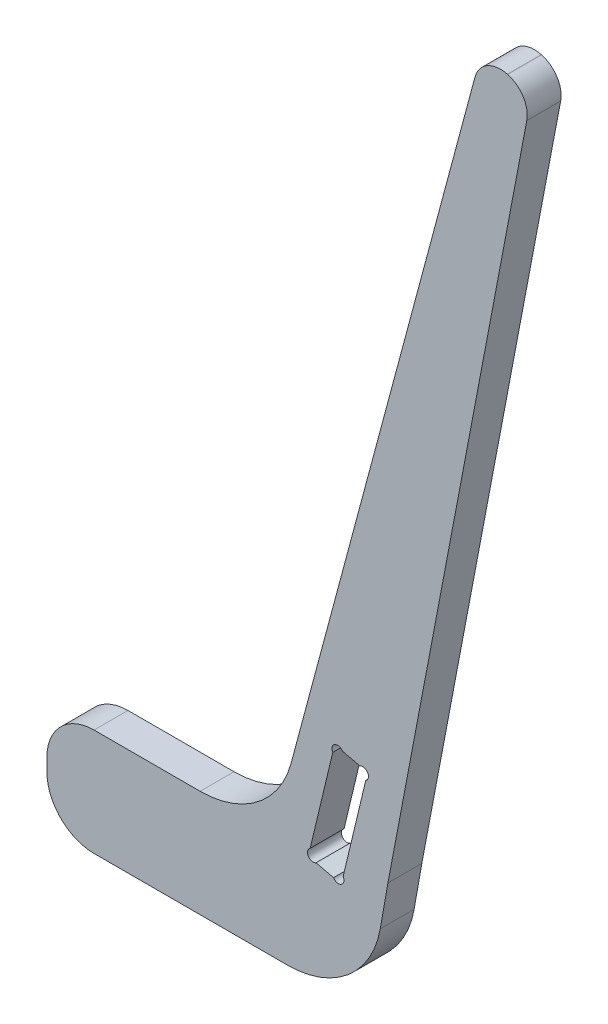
ISO-10303-21;
HEADER;
FILE_DESCRIPTION(('STEP AP214'),'2;1');
FILE_NAME('part.step','',(''),(''),'','','');
FILE_SCHEMA(('AUTOMOTIVE_DESIGN { 1 0 10303 214 1 1 1 1 }'));
ENDSEC;
DATA;
#1=APPLICATION_CONTEXT('core data for automotive mechanical design processes');
#2=APPLICATION_PROTOCOL_DEFINITION('international standard','automotive_design',2000,#1);
#3=PRODUCT_CONTEXT('',#1,'mechanical');
#4=PRODUCT('Part','Part','',(#3));
#5=PRODUCT_RELATED_PRODUCT_CATEGORY('part','',(#4));
#6=PRODUCT_DEFINITION_FORMATION('','',#4);
#7=PRODUCT_DEFINITION_CONTEXT('part definition',#1,'design');
#8=PRODUCT_DEFINITION('design','',#6,#7);
#9=PRODUCT_DEFINITION_SHAPE('','',#8);
#10=(LENGTH_UNIT() NAMED_UNIT(*) SI_UNIT(.MILLI.,.METRE.));
#11=(NAMED_UNIT(*) PLANE_ANGLE_UNIT() SI_UNIT($,.RADIAN.));
#12=(NAMED_UNIT(*) SI_UNIT($,.STERADIAN.) SOLID_ANGLE_UNIT());
#13=UNCERTAINTY_MEASURE_WITH_UNIT(LENGTH_MEASURE(1.E-05),#10,'distance_accuracy_value','');
#14=(GEOMETRIC_REPRESENTATION_CONTEXT(3) GLOBAL_UNCERTAINTY_ASSIGNED_CONTEXT((#13)) GLOBAL_UNIT_ASSIGNED_CONTEXT((#10,
#11,#12)) REPRESENTATION_CONTEXT('',''));
#15=CARTESIAN_POINT('',(0.,0.,0.));
#16=DIRECTION('',(0.,0.,1.));
#17=DIRECTION('',(1.,0.,0.));
#18=AXIS2_PLACEMENT_3D('',#15,#16,#17);
#19=CARTESIAN_POINT('',(589.307159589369,-157.904377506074,18.));
#20=DIRECTION('',(0.965925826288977,-0.258819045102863,0.));
#21=DIRECTION('',(0.258819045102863,0.965925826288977,0.));
#22=AXIS2_PLACEMENT_3D('',#19,#20,#21);
#23=PLANE('',#22);
#24=DIRECTION('',(-0.258819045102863,-0.965925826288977,0.));
#25=VECTOR('',#24,1.);
#26=CARTESIAN_POINT('',(589.307159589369,-157.904377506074,18.));
#27=LINE('',#26,#25);
#28=CARTESIAN_POINT('',(735.435185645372,387.452840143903,18.));
#29=VERTEX_POINT('',#28);
#30=CARTESIAN_POINT('',(637.838508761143,23.2170833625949,18.));
#31=VERTEX_POINT('',#30);
#32=EDGE_CURVE('E318',#29,#31,#27,.T.);
#33=ORIENTED_EDGE('',*,*,#32,.F.);
#34=DIRECTION('',(0.,0.,-1.));
#35=VECTOR('',#34,1.);
#36=CARTESIAN_POINT('',(735.435185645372,387.452840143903,0.));
#37=LINE('',#36,#35);
#38=CARTESIAN_POINT('',(735.435185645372,387.452840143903,0.));
#39=VERTEX_POINT('',#38);
#40=EDGE_CURVE('E186',#29,#39,#37,.T.);
#41=ORIENTED_EDGE('',*,*,#40,.T.);
#42=DIRECTION('',(-0.258819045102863,-0.965925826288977,0.));
#43=VECTOR('',#42,1.);
#44=CARTESIAN_POINT('',(589.307159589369,-157.904377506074,0.));
#45=LINE('',#44,#43);
#46=CARTESIAN_POINT('',(637.838508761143,23.2170833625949,0.));
#47=VERTEX_POINT('',#46);
#48=EDGE_CURVE('E217',#39,#47,#45,.T.);
#49=ORIENTED_EDGE('',*,*,#48,.T.);
#50=DIRECTION('',(0.,0.,-1.));
#51=VECTOR('',#50,1.);
#52=CARTESIAN_POINT('',(637.838508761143,23.2170833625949,18.));
#53=LINE('',#52,#51);
#54=EDGE_CURVE('E251',#31,#47,#53,.T.);
#55=ORIENTED_EDGE('',*,*,#54,.F.);
#56=EDGE_LOOP('',(#33,#41,#49,#55));
#57=FACE_BOUND('',#56,.T.);
#58=ADVANCED_FACE('F35',(#57),#23,.F.);
#59=CARTESIAN_POINT('',(589.542217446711,36.1580356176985,18.));
#60=DIRECTION('',(0.,0.,-1.));
#61=DIRECTION('',(-1.,0.,0.));
#62=AXIS2_PLACEMENT_3D('',#59,#60,#61);
#63=CYLINDRICAL_SURFACE('',#62,50.);
#64=CARTESIAN_POINT('',(589.542217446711,36.1580356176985,0.));
#65=DIRECTION('',(0.,0.,1.));
#66=DIRECTION('',(1.,0.,0.));
#67=AXIS2_PLACEMENT_3D('',#64,#65,#66);
#68=CIRCLE('',#67,50.);
#69=CARTESIAN_POINT('',(589.542217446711,-13.8419643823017,0.));
#70=VERTEX_POINT('',#69);
#71=EDGE_CURVE('E219',#47,#70,#68,.F.);
#72=ORIENTED_EDGE('',*,*,#71,.T.);
#73=DIRECTION('',(0.,0.,-1.));
#74=VECTOR('',#73,1.);
#75=CARTESIAN_POINT('',(589.542217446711,-13.8419643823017,18.));
#76=LINE('',#75,#74);
#77=CARTESIAN_POINT('',(589.542217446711,-13.8419643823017,18.));
#78=VERTEX_POINT('',#77);
#79=EDGE_CURVE('E248',#78,#70,#76,.T.);
#80=ORIENTED_EDGE('',*,*,#79,.F.);
#81=CARTESIAN_POINT('',(589.542217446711,36.1580356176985,18.));
#82=DIRECTION('',(0.,0.,1.));
#83=DIRECTION('',(1.,0.,0.));
#84=AXIS2_PLACEMENT_3D('',#81,#82,#83);
#85=CIRCLE('',#84,50.);
#86=EDGE_CURVE('E320',#31,#78,#85,.F.);
#87=ORIENTED_EDGE('',*,*,#86,.F.);
#88=ORIENTED_EDGE('',*,*,#54,.T.);
#89=EDGE_LOOP('',(#72,#80,#87,#88));
#90=FACE_BOUND('',#89,.T.);
#91=ADVANCED_FACE('F390',(#90),#63,.F.);
#92=CARTESIAN_POINT('',(0.,-13.8419643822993,18.));
#93=DIRECTION('',(0.,1.,0.));
#94=DIRECTION('',(-1.,0.,0.));
#95=AXIS2_PLACEMENT_3D('',#92,#93,#94);
#96=PLANE('',#95);
#97=DIRECTION('',(1.,0.,0.));
#98=VECTOR('',#97,1.);
#99=CARTESIAN_POINT('',(0.,-13.8419643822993,0.));
#100=LINE('',#99,#98);
#101=CARTESIAN_POINT('',(533.208645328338,-13.8419643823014,0.));
#102=VERTEX_POINT('',#101);
#103=EDGE_CURVE('E222',#102,#70,#100,.T.);
#104=ORIENTED_EDGE('',*,*,#103,.F.);
#105=DIRECTION('',(0.,0.,-1.));
#106=VECTOR('',#105,1.);
#107=CARTESIAN_POINT('',(533.208645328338,-13.8419643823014,18.));
#108=LINE('',#107,#106);
#109=CARTESIAN_POINT('',(533.208645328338,-13.8419643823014,18.));
#110=VERTEX_POINT('',#109);
#111=EDGE_CURVE('E270',#102,#110,#108,.F.);
#112=ORIENTED_EDGE('',*,*,#111,.T.);
#113=DIRECTION('',(1.,0.,0.));
#114=VECTOR('',#113,1.);
#115=CARTESIAN_POINT('',(0.,-13.8419643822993,18.));
#116=LINE('',#115,#114);
#117=EDGE_CURVE('E323',#110,#78,#116,.T.);
#118=ORIENTED_EDGE('',*,*,#117,.T.);
#119=ORIENTED_EDGE('',*,*,#79,.T.);
#120=EDGE_LOOP('',(#104,#112,#118,#119));
#121=FACE_BOUND('',#120,.T.);
#122=ADVANCED_FACE('F386',(#121),#96,.T.);
#123=CARTESIAN_POINT('',(508.208645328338,0.,18.));
#124=DIRECTION('',(1.,0.,0.));
#125=DIRECTION('',(0.,0.,-1.));
#126=AXIS2_PLACEMENT_3D('',#123,#124,#125);
#127=PLANE('',#126);
#128=DIRECTION('',(0.,-1.,0.));
#129=VECTOR('',#128,1.);
#130=CARTESIAN_POINT('',(508.208645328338,0.,0.));
#131=LINE('',#130,#129);
#132=CARTESIAN_POINT('',(508.208645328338,-38.8419643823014,0.));
#133=VERTEX_POINT('',#132);
#134=CARTESIAN_POINT('',(508.208645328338,-45.5961637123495,0.));
#135=VERTEX_POINT('',#134);
#136=EDGE_CURVE('E224',#133,#135,#131,.T.);
#137=ORIENTED_EDGE('',*,*,#136,.T.);
#138=DIRECTION('',(0.,0.,-1.));
#139=VECTOR('',#138,1.);
#140=CARTESIAN_POINT('',(508.208645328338,-45.5961637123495,18.));
#141=LINE('',#140,#139);
#142=CARTESIAN_POINT('',(508.208645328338,-45.5961637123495,18.));
#143=VERTEX_POINT('',#142);
#144=EDGE_CURVE('E264',#135,#143,#141,.F.);
#145=ORIENTED_EDGE('',*,*,#144,.T.);
#146=DIRECTION('',(0.,-1.,0.));
#147=VECTOR('',#146,1.);
#148=CARTESIAN_POINT('',(508.208645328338,0.,18.));
#149=LINE('',#148,#147);
#150=CARTESIAN_POINT('',(508.208645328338,-38.8419643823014,18.));
#151=VERTEX_POINT('',#150);
#152=EDGE_CURVE('E325',#151,#143,#149,.T.);
#153=ORIENTED_EDGE('',*,*,#152,.F.);
#154=DIRECTION('',(0.,0.,-1.));
#155=VECTOR('',#154,1.);
#156=CARTESIAN_POINT('',(508.208645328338,-38.8419643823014,0.));
#157=LINE('',#156,#155);
#158=EDGE_CURVE('E261',#151,#133,#157,.T.);
#159=ORIENTED_EDGE('',*,*,#158,.T.);
#160=EDGE_LOOP('',(#137,#145,#153,#159));
#161=FACE_BOUND('',#160,.T.);
#162=ADVANCED_FACE('F372',(#161),#127,.F.);
#163=CARTESIAN_POINT('',(0.,-70.5961637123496,18.));
#164=DIRECTION('',(0.,1.,0.));
#165=DIRECTION('',(0.,0.,1.));
#166=AXIS2_PLACEMENT_3D('',#163,#164,#165);
#167=PLANE('',#166);
#168=DIRECTION('',(1.,0.,0.));
#169=VECTOR('',#168,1.);
#170=CARTESIAN_POINT('',(0.,-70.5961637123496,18.));
#171=LINE('',#170,#169);
#172=CARTESIAN_POINT('',(533.208645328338,-70.5961637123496,18.));
#173=VERTEX_POINT('',#172);
#174=CARTESIAN_POINT('',(635.90289442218,-70.5961637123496,18.));
#175=VERTEX_POINT('',#174);
#176=EDGE_CURVE('E328',#173,#175,#171,.T.);
#177=ORIENTED_EDGE('',*,*,#176,.F.);
#178=DIRECTION('',(0.,0.,-1.));
#179=VECTOR('',#178,1.);
#180=CARTESIAN_POINT('',(533.208645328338,-70.5961637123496,18.));
#181=LINE('',#180,#179);
#182=CARTESIAN_POINT('',(533.208645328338,-70.5961637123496,0.));
#183=VERTEX_POINT('',#182);
#184=EDGE_CURVE('E254',#173,#183,#181,.T.);
#185=ORIENTED_EDGE('',*,*,#184,.T.);
#186=DIRECTION('',(1.,0.,0.));
#187=VECTOR('',#186,1.);
#188=CARTESIAN_POINT('',(0.,-70.5961637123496,0.));
#189=LINE('',#188,#187);
#190=CARTESIAN_POINT('',(635.90289442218,-70.5961637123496,0.));
#191=VERTEX_POINT('',#190);
#192=EDGE_CURVE('E227',#183,#191,#189,.T.);
#193=ORIENTED_EDGE('',*,*,#192,.T.);
#194=DIRECTION('',(0.,0.,-1.));
#195=VECTOR('',#194,1.);
#196=CARTESIAN_POINT('',(635.90289442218,-70.5961637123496,18.));
#197=LINE('',#196,#195);
#198=EDGE_CURVE('E245',#175,#191,#197,.T.);
#199=ORIENTED_EDGE('',*,*,#198,.F.);
#200=EDGE_LOOP('',(#177,#185,#193,#199));
#201=FACE_BOUND('',#200,.T.);
#202=ADVANCED_FACE('F366',(#201),#167,.F.);
#203=CARTESIAN_POINT('',(635.90289442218,-20.5961637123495,18.));
#204=DIRECTION('',(0.,0.,-1.));
#205=DIRECTION('',(-1.,0.,0.));
#206=AXIS2_PLACEMENT_3D('',#203,#204,#205);
#207=CYLINDRICAL_SURFACE('',#206,50.0000000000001);
#208=CARTESIAN_POINT('',(635.90289442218,-20.5961637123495,0.));
#209=DIRECTION('',(0.,0.,1.));
#210=DIRECTION('',(1.,0.,0.));
#211=AXIS2_PLACEMENT_3D('',#208,#209,#210);
#212=CIRCLE('',#211,50.0000000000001);
#213=CARTESIAN_POINT('',(685.14328207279,-29.2785725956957,0.));
#214=VERTEX_POINT('',#213);
#215=EDGE_CURVE('E229',#214,#191,#212,.F.);
#216=ORIENTED_EDGE('',*,*,#215,.F.);
#217=DIRECTION('',(0.,0.,-1.));
#218=VECTOR('',#217,1.);
#219=CARTESIAN_POINT('',(685.14328207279,-29.2785725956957,18.));
#220=LINE('',#219,#218);
#221=CARTESIAN_POINT('',(685.14328207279,-29.2785725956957,18.));
#222=VERTEX_POINT('',#221);
#223=EDGE_CURVE('E243',#222,#214,#220,.T.);
#224=ORIENTED_EDGE('',*,*,#223,.F.);
#225=CARTESIAN_POINT('',(635.90289442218,-20.5961637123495,18.));
#226=DIRECTION('',(0.,0.,1.));
#227=DIRECTION('',(1.,0.,0.));
#228=AXIS2_PLACEMENT_3D('',#225,#226,#227);
#229=CIRCLE('',#228,50.0000000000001);
#230=EDGE_CURVE('E330',#222,#175,#229,.F.);
#231=ORIENTED_EDGE('',*,*,#230,.T.);
#232=ORIENTED_EDGE('',*,*,#198,.T.);
#233=EDGE_LOOP('',(#216,#224,#231,#232));
#234=FACE_BOUND('',#233,.T.);
#235=ADVANCED_FACE('F361',(#234),#207,.T.);
#236=CARTESIAN_POINT('',(669.490615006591,-118.049258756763,18.));
#237=DIRECTION('',(-0.984807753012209,0.173648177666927,0.));
#238=DIRECTION('',(-0.173648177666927,-0.984807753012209,0.));
#239=AXIS2_PLACEMENT_3D('',#236,#237,#238);
#240=PLANE('',#239);
#241=DIRECTION('',(0.173648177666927,0.984807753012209,0.));
#242=VECTOR('',#241,1.);
#243=CARTESIAN_POINT('',(669.490615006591,-118.049258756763,0.));
#244=LINE('',#243,#242);
#245=CARTESIAN_POINT('',(689.222605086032,-6.14358215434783,0.));
#246=VERTEX_POINT('',#245);
#247=EDGE_CURVE('E232',#214,#246,#244,.T.);
#248=ORIENTED_EDGE('',*,*,#247,.T.);
#249=DIRECTION('',(0.,0.,-1.));
#250=VECTOR('',#249,1.);
#251=CARTESIAN_POINT('',(689.222605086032,-6.14358215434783,18.));
#252=LINE('',#251,#250);
#253=CARTESIAN_POINT('',(689.222605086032,-6.14358215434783,18.));
#254=VERTEX_POINT('',#253);
#255=EDGE_CURVE('E240',#254,#246,#252,.T.);
#256=ORIENTED_EDGE('',*,*,#255,.F.);
#257=DIRECTION('',(0.173648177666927,0.984807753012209,0.));
#258=VECTOR('',#257,1.);
#259=CARTESIAN_POINT('',(669.490615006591,-118.049258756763,18.));
#260=LINE('',#259,#258);
#261=EDGE_CURVE('E333',#222,#254,#260,.T.);
#262=ORIENTED_EDGE('',*,*,#261,.F.);
#263=ORIENTED_EDGE('',*,*,#223,.T.);
#264=EDGE_LOOP('',(#248,#256,#262,#263));
#265=FACE_BOUND('',#264,.T.);
#266=ADVANCED_FACE('F357',(#265),#240,.F.);
#267=CARTESIAN_POINT('',(666.270873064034,-126.771049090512,18.));
#268=DIRECTION('',(0.98237586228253,-0.18691619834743,0.));
#269=DIRECTION('',(0.18691619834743,0.98237586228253,0.));
#270=AXIS2_PLACEMENT_3D('',#267,#268,#269);
#271=PLANE('',#270);
#272=DIRECTION('',(-0.18691619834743,-0.98237586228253,0.));
#273=VECTOR('',#272,1.);
#274=CARTESIAN_POINT('',(666.270873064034,-126.771049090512,0.));
#275=LINE('',#274,#273);
#276=CARTESIAN_POINT('',(762.914330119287,381.158174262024,0.));
#277=VERTEX_POINT('',#276);
#278=EDGE_CURVE('E235',#277,#246,#275,.T.);
#279=ORIENTED_EDGE('',*,*,#278,.F.);
#280=DIRECTION('',(0.,0.,-1.));
#281=VECTOR('',#280,1.);
#282=CARTESIAN_POINT('',(762.914330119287,381.158174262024,18.));
#283=LINE('',#282,#281);
#284=CARTESIAN_POINT('',(762.914330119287,381.158174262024,18.));
#285=VERTEX_POINT('',#284);
#286=EDGE_CURVE('E281',#277,#285,#283,.F.);
#287=ORIENTED_EDGE('',*,*,#286,.T.);
#288=DIRECTION('',(-0.18691619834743,-0.98237586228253,0.));
#289=VECTOR('',#288,1.);
#290=CARTESIAN_POINT('',(666.270873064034,-126.771049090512,18.));
#291=LINE('',#290,#289);
#292=EDGE_CURVE('E335',#285,#254,#291,.T.);
#293=ORIENTED_EDGE('',*,*,#292,.T.);
#294=ORIENTED_EDGE('',*,*,#255,.T.);
#295=EDGE_LOOP('',(#279,#287,#293,#294));
#296=FACE_BOUND('',#295,.T.);
#297=ADVANCED_FACE('F353',(#296),#271,.T.);
#298=CARTESIAN_POINT('',(45.6823105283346,190.746845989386,18.));
#299=DIRECTION('',(0.232905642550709,0.972499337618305,0.));
#300=DIRECTION('',(-0.972499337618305,0.232905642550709,0.));
#301=AXIS2_PLACEMENT_3D('',#298,#299,#300);
#302=PLANE('',#301);
#303=DIRECTION('',(0.972499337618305,-0.232905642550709,0.));
#304=VECTOR('',#303,1.);
#305=CARTESIAN_POINT('',(45.6823105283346,190.746845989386,0.));
#306=LINE('',#305,#304);
#307=CARTESIAN_POINT('',(665.060908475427,42.4107343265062,0.));
#308=VERTEX_POINT('',#307);
#309=CARTESIAN_POINT('',(674.313966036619,40.1947026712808,0.));
#310=VERTEX_POINT('',#309);
#311=EDGE_CURVE('E193',#308,#310,#306,.T.);
#312=ORIENTED_EDGE('',*,*,#311,.T.);
#313=DIRECTION('',(0.,0.,1.));
#314=VECTOR('',#313,1.);
#315=CARTESIAN_POINT('',(674.313966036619,40.1947026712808,0.));
#316=LINE('',#315,#314);
#317=CARTESIAN_POINT('',(674.313966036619,40.1947026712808,18.));
#318=VERTEX_POINT('',#317);
#319=EDGE_CURVE('E300',#310,#318,#316,.T.);
#320=ORIENTED_EDGE('',*,*,#319,.T.);
#321=DIRECTION('',(0.972499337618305,-0.232905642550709,0.));
#322=VECTOR('',#321,1.);
#323=CARTESIAN_POINT('',(45.6823105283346,190.746845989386,18.));
#324=LINE('',#323,#322);
#325=CARTESIAN_POINT('',(665.060908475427,42.4107343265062,18.));
#326=VERTEX_POINT('',#325);
#327=EDGE_CURVE('E195',#326,#318,#324,.T.);
#328=ORIENTED_EDGE('',*,*,#327,.F.);
#329=DIRECTION('',(0.,0.,1.));
#330=VECTOR('',#329,1.);
#331=CARTESIAN_POINT('',(665.060908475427,42.4107343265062,0.));
#332=LINE('',#331,#330);
#333=EDGE_CURVE('E179',#326,#308,#332,.F.);
#334=ORIENTED_EDGE('',*,*,#333,.T.);
#335=EDGE_LOOP('',(#312,#320,#328,#334));
#336=FACE_BOUND('',#335,.T.);
#337=ADVANCED_FACE('F191',(#336),#302,.F.);
#338=CARTESIAN_POINT('',(632.757620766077,-151.540278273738,18.));
#339=DIRECTION('',(0.972499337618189,-0.232905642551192,0.));
#340=DIRECTION('',(0.232905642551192,0.972499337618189,0.));
#341=AXIS2_PLACEMENT_3D('',#338,#339,#340);
#342=PLANE('',#341);
#343=DIRECTION('',(-0.232905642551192,-0.972499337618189,0.));
#344=VECTOR('',#343,1.);
#345=CARTESIAN_POINT('',(632.757620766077,-151.540278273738,0.));
#346=LINE('',#345,#344);
#347=CARTESIAN_POINT('',(677.451796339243,35.080602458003,0.));
#348=VERTEX_POINT('',#347);
#349=CARTESIAN_POINT('',(665.45372769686,-15.0174272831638,0.));
#350=VERTEX_POINT('',#349);
#351=EDGE_CURVE('E202',#348,#350,#346,.T.);
#352=ORIENTED_EDGE('',*,*,#351,.T.);
#353=DIRECTION('',(0.,0.,1.));
#354=VECTOR('',#353,1.);
#355=CARTESIAN_POINT('',(665.45372769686,-15.0174272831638,0.));
#356=LINE('',#355,#354);
#357=CARTESIAN_POINT('',(665.45372769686,-15.0174272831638,18.));
#358=VERTEX_POINT('',#357);
#359=EDGE_CURVE('E50',#350,#358,#356,.T.);
#360=ORIENTED_EDGE('',*,*,#359,.T.);
#361=DIRECTION('',(-0.232905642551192,-0.972499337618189,0.));
#362=VECTOR('',#361,1.);
#363=CARTESIAN_POINT('',(632.757620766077,-151.540278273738,18.));
#364=LINE('',#363,#362);
#365=CARTESIAN_POINT('',(677.451796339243,35.080602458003,18.));
#366=VERTEX_POINT('',#365);
#367=EDGE_CURVE('E298',#366,#358,#364,.T.);
#368=ORIENTED_EDGE('',*,*,#367,.F.);
#369=DIRECTION('',(0.,0.,1.));
#370=VECTOR('',#369,1.);
#371=CARTESIAN_POINT('',(677.451796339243,35.080602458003,0.));
#372=LINE('',#371,#370);
#373=EDGE_CURVE('E196',#366,#348,#372,.F.);
#374=ORIENTED_EDGE('',*,*,#373,.T.);
#375=EDGE_LOOP('',(#352,#360,#368,#374));
#376=FACE_BOUND('',#375,.T.);
#377=ADVANCED_FACE('F294',(#376),#342,.F.);
#378=CARTESIAN_POINT('',(31.707971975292,132.396885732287,18.));
#379=DIRECTION('',(0.232905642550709,0.972499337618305,0.));
#380=DIRECTION('',(-0.972499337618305,0.232905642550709,0.));
#381=AXIS2_PLACEMENT_3D('',#378,#379,#380);
#382=PLANE('',#381);
#383=DIRECTION('',(0.,0.,1.));
#384=VECTOR('',#383,1.);
#385=CARTESIAN_POINT('',(651.086569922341,-15.9392259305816,0.));
#386=LINE('',#385,#384);
#387=CARTESIAN_POINT('',(651.086569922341,-15.9392259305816,18.));
#388=VERTEX_POINT('',#387);
#389=CARTESIAN_POINT('',(651.086569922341,-15.9392259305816,0.));
#390=VERTEX_POINT('',#389);
#391=EDGE_CURVE('E203',#388,#390,#386,.F.);
#392=ORIENTED_EDGE('',*,*,#391,.F.);
#393=DIRECTION('',(0.972499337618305,-0.232905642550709,0.));
#394=VECTOR('',#393,1.);
#395=CARTESIAN_POINT('',(31.707971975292,132.396885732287,18.));
#396=LINE('',#395,#394);
#397=CARTESIAN_POINT('',(660.339627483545,-18.1552575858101,18.));
#398=VERTEX_POINT('',#397);
#399=EDGE_CURVE('E312',#388,#398,#396,.T.);
#400=ORIENTED_EDGE('',*,*,#399,.T.);
#401=DIRECTION('',(0.,0.,1.));
#402=VECTOR('',#401,1.);
#403=CARTESIAN_POINT('',(660.339627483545,-18.15525758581,0.));
#404=LINE('',#403,#402);
#405=CARTESIAN_POINT('',(660.339627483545,-18.1552575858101,0.));
#406=VERTEX_POINT('',#405);
#407=EDGE_CURVE('E302',#406,#398,#404,.T.);
#408=ORIENTED_EDGE('',*,*,#407,.F.);
#409=DIRECTION('',(0.972499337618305,-0.232905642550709,0.));
#410=VECTOR('',#409,1.);
#411=CARTESIAN_POINT('',(31.707971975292,132.396885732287,0.));
#412=LINE('',#411,#410);
#413=EDGE_CURVE('E206',#390,#406,#412,.T.);
#414=ORIENTED_EDGE('',*,*,#413,.F.);
#415=EDGE_LOOP('',(#392,#400,#408,#414));
#416=FACE_BOUND('',#415,.T.);
#417=ADVANCED_FACE('F415',(#416),#382,.T.);
#418=CARTESIAN_POINT('',(615.252632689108,-147.34797670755,18.));
#419=DIRECTION('',(0.972499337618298,-0.232905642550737,0.));
#420=DIRECTION('',(0.232905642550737,0.972499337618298,0.));
#421=AXIS2_PLACEMENT_3D('',#418,#419,#420);
#422=PLANE('',#421);
#423=DIRECTION('',(0.,0.,1.));
#424=VECTOR('',#423,1.);
#425=CARTESIAN_POINT('',(647.948739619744,-10.8251257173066,0.));
#426=LINE('',#425,#424);
#427=CARTESIAN_POINT('',(647.948739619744,-10.8251257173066,0.));
#428=VERTEX_POINT('',#427);
#429=CARTESIAN_POINT('',(647.948739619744,-10.8251257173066,18.));
#430=VERTEX_POINT('',#429);
#431=EDGE_CURVE('E208',#428,#430,#426,.T.);
#432=ORIENTED_EDGE('',*,*,#431,.F.);
#433=DIRECTION('',(-0.232905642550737,-0.972499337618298,0.));
#434=VECTOR('',#433,1.);
#435=CARTESIAN_POINT('',(615.252632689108,-147.34797670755,0.));
#436=LINE('',#435,#434);
#437=CARTESIAN_POINT('',(659.946808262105,39.2729040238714,0.));
#438=VERTEX_POINT('',#437);
#439=EDGE_CURVE('E215',#438,#428,#436,.T.);
#440=ORIENTED_EDGE('',*,*,#439,.F.);
#441=DIRECTION('',(0.,0.,1.));
#442=VECTOR('',#441,1.);
#443=CARTESIAN_POINT('',(659.946808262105,39.2729040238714,0.));
#444=LINE('',#443,#442);
#445=CARTESIAN_POINT('',(659.946808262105,39.2729040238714,18.));
#446=VERTEX_POINT('',#445);
#447=EDGE_CURVE('E182',#446,#438,#444,.F.);
#448=ORIENTED_EDGE('',*,*,#447,.F.);
#449=DIRECTION('',(-0.232905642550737,-0.972499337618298,0.));
#450=VECTOR('',#449,1.);
#451=CARTESIAN_POINT('',(615.252632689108,-147.34797670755,18.));
#452=LINE('',#451,#450);
#453=EDGE_CURVE('E315',#446,#430,#452,.T.);
#454=ORIENTED_EDGE('',*,*,#453,.T.);
#455=EDGE_LOOP('',(#432,#440,#448,#454));
#456=FACE_BOUND('',#455,.T.);
#457=ADVANCED_FACE('F412',(#456),#422,.T.);
#458=CARTESIAN_POINT('',(149.751492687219,558.880179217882,18.));
#459=DIRECTION('',(0.258819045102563,0.965925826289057,0.));
#460=DIRECTION('',(-0.965925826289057,0.258819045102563,0.));
#461=AXIS2_PLACEMENT_3D('',#458,#459,#460);
#462=PLANE('',#461);
#463=DIRECTION('',(0.965925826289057,-0.258819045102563,0.));
#464=VECTOR('',#463,1.);
#465=CARTESIAN_POINT('',(149.751492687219,558.880179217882,18.));
#466=LINE('',#465,#464);
#467=CARTESIAN_POINT('',(752.581613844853,397.35233508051,18.));
#468=VERTEX_POINT('',#467);
#469=CARTESIAN_POINT('',(752.784534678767,397.297962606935,18.));
#470=VERTEX_POINT('',#469);
#471=EDGE_CURVE('E211',#468,#470,#466,.T.);
#472=ORIENTED_EDGE('',*,*,#471,.T.);
#473=DIRECTION('',(0.,0.,-1.));
#474=VECTOR('',#473,1.);
#475=CARTESIAN_POINT('',(752.784534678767,397.297962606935,18.));
#476=LINE('',#475,#474);
#477=CARTESIAN_POINT('',(752.784534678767,397.297962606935,0.));
#478=VERTEX_POINT('',#477);
#479=EDGE_CURVE('E274',#470,#478,#476,.T.);
#480=ORIENTED_EDGE('',*,*,#479,.T.);
#481=DIRECTION('',(0.965925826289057,-0.258819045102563,0.));
#482=VECTOR('',#481,1.);
#483=CARTESIAN_POINT('',(149.751492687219,558.880179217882,0.));
#484=LINE('',#483,#482);
#485=CARTESIAN_POINT('',(752.581613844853,397.35233508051,0.));
#486=VERTEX_POINT('',#485);
#487=EDGE_CURVE('E237',#486,#478,#484,.T.);
#488=ORIENTED_EDGE('',*,*,#487,.F.);
#489=DIRECTION('',(0.,0.,-1.));
#490=VECTOR('',#489,1.);
#491=CARTESIAN_POINT('',(752.581613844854,397.35233508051,18.));
#492=LINE('',#491,#490);
#493=EDGE_CURVE('E272',#486,#468,#492,.F.);
#494=ORIENTED_EDGE('',*,*,#493,.T.);
#495=EDGE_LOOP('',(#472,#480,#488,#494));
#496=FACE_BOUND('',#495,.T.);
#497=ADVANCED_FACE('F342',(#496),#462,.T.);
#498=CARTESIAN_POINT('',(0.,0.,18.));
#499=DIRECTION('',(0.,0.,1.));
#500=DIRECTION('',(1.,0.,0.));
#501=AXIS2_PLACEMENT_3D('',#498,#499,#500);
#502=PLANE('',#501);
#503=CARTESIAN_POINT('',(649.517654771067,-13.3821758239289,18.));
#504=DIRECTION('',(0.,0.,1.));
#505=DIRECTION('',(-1.,0.,0.));
#506=AXIS2_PLACEMENT_3D('',#503,#504,#505);
#507=CIRCLE('',#506,2.99999999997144);
#508=EDGE_CURVE('E707',#430,#388,#507,.T.);
#509=ORIENTED_EDGE('',*,*,#508,.F.);
#510=ORIENTED_EDGE('',*,*,#453,.F.);
#511=CARTESIAN_POINT('',(662.503858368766,40.8418191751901,18.));
#512=DIRECTION('',(0.,0.,1.));
#513=DIRECTION('',(1.,0.,0.));
#514=AXIS2_PLACEMENT_3D('',#511,#512,#513);
#515=CIRCLE('',#514,3.00000000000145);
#516=EDGE_CURVE('E712',#326,#446,#515,.T.);
#517=ORIENTED_EDGE('',*,*,#516,.F.);
#518=ORIENTED_EDGE('',*,*,#327,.T.);
#519=CARTESIAN_POINT('',(675.882881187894,37.6376525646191,18.));
#520=DIRECTION('',(0.,0.,1.));
#521=DIRECTION('',(-1.,0.,0.));
#522=AXIS2_PLACEMENT_3D('',#519,#520,#521);
#523=CIRCLE('',#522,2.99999999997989);
#524=EDGE_CURVE('E710',#366,#318,#523,.T.);
#525=ORIENTED_EDGE('',*,*,#524,.F.);
#526=ORIENTED_EDGE('',*,*,#367,.T.);
#527=CARTESIAN_POINT('',(662.8966775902,-16.5863424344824,18.));
#528=DIRECTION('',(0.,0.,1.));
#529=DIRECTION('',(1.,0.,0.));
#530=AXIS2_PLACEMENT_3D('',#527,#528,#529);
#531=CIRCLE('',#530,3.00000000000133);
#532=EDGE_CURVE('E709',#398,#358,#531,.T.);
#533=ORIENTED_EDGE('',*,*,#532,.F.);
#534=ORIENTED_EDGE('',*,*,#399,.F.);
#535=EDGE_LOOP('',(#509,#510,#517,#518,#525,#526,#533,#534));
#536=FACE_BOUND('',#535,.T.);
#537=ORIENTED_EDGE('',*,*,#292,.F.);
#538=CARTESIAN_POINT('',(749.161068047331,383.775001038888,18.));
#539=DIRECTION('',(0.,0.,1.));
#540=DIRECTION('',(1.,0.,0.));
#541=AXIS2_PLACEMENT_3D('',#538,#539,#540);
#542=CIRCLE('',#541,14.);
#543=EDGE_CURVE('E285',#285,#470,#542,.T.);
#544=ORIENTED_EDGE('',*,*,#543,.T.);
#545=ORIENTED_EDGE('',*,*,#471,.F.);
#546=CARTESIAN_POINT('',(748.958147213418,383.829373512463,18.));
#547=DIRECTION('',(0.,0.,1.));
#548=DIRECTION('',(1.,0.,0.));
#549=AXIS2_PLACEMENT_3D('',#546,#547,#548);
#550=CIRCLE('',#549,14.);
#551=EDGE_CURVE('E283',#468,#29,#550,.T.);
#552=ORIENTED_EDGE('',*,*,#551,.T.);
#553=ORIENTED_EDGE('',*,*,#32,.T.);
#554=ORIENTED_EDGE('',*,*,#86,.T.);
#555=ORIENTED_EDGE('',*,*,#117,.F.);
#556=CARTESIAN_POINT('',(533.208645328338,-38.8419643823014,18.));
#557=DIRECTION('',(0.,0.,1.));
#558=DIRECTION('',(1.,0.,0.));
#559=AXIS2_PLACEMENT_3D('',#556,#557,#558);
#560=CIRCLE('',#559,25.);
#561=EDGE_CURVE('E266',#110,#151,#560,.T.);
#562=ORIENTED_EDGE('',*,*,#561,.T.);
#563=ORIENTED_EDGE('',*,*,#152,.T.);
#564=CARTESIAN_POINT('',(533.208645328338,-45.5961637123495,18.));
#565=DIRECTION('',(0.,0.,1.));
#566=DIRECTION('',(1.,0.,0.));
#567=AXIS2_PLACEMENT_3D('',#564,#565,#566);
#568=CIRCLE('',#567,25.);
#569=EDGE_CURVE('E268',#143,#173,#568,.T.);
#570=ORIENTED_EDGE('',*,*,#569,.T.);
#571=ORIENTED_EDGE('',*,*,#176,.T.);
#572=ORIENTED_EDGE('',*,*,#230,.F.);
#573=ORIENTED_EDGE('',*,*,#261,.T.);
#574=EDGE_LOOP('',(#537,#544,#545,#552,#553,#554,#555,#562,#563,#570,#571,#572,#573));
#575=FACE_BOUND('',#574,.T.);
#576=ADVANCED_FACE('F377',(#536,#575),#502,.T.);
#577=CARTESIAN_POINT('',(0.,0.,0.));
#578=DIRECTION('',(0.,0.,1.));
#579=DIRECTION('',(1.,0.,0.));
#580=AXIS2_PLACEMENT_3D('',#577,#578,#579);
#581=PLANE('',#580);
#582=ORIENTED_EDGE('',*,*,#439,.T.);
#583=CARTESIAN_POINT('',(649.517654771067,-13.3821758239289,0.));
#584=DIRECTION('',(0.,0.,1.));
#585=DIRECTION('',(1.,0.,0.));
#586=AXIS2_PLACEMENT_3D('',#583,#584,#585);
#587=CIRCLE('',#586,2.99999999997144);
#588=EDGE_CURVE('E11',#428,#390,#587,.T.);
#589=ORIENTED_EDGE('',*,*,#588,.T.);
#590=ORIENTED_EDGE('',*,*,#413,.T.);
#591=CARTESIAN_POINT('',(662.8966775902,-16.5863424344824,0.));
#592=DIRECTION('',(0.,0.,1.));
#593=DIRECTION('',(1.,0.,0.));
#594=AXIS2_PLACEMENT_3D('',#591,#592,#593);
#595=CIRCLE('',#594,3.00000000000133);
#596=EDGE_CURVE('E43',#406,#350,#595,.T.);
#597=ORIENTED_EDGE('',*,*,#596,.T.);
#598=ORIENTED_EDGE('',*,*,#351,.F.);
#599=CARTESIAN_POINT('',(675.882881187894,37.6376525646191,0.));
#600=DIRECTION('',(0.,0.,1.));
#601=DIRECTION('',(1.,0.,0.));
#602=AXIS2_PLACEMENT_3D('',#599,#600,#601);
#603=CIRCLE('',#602,2.99999999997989);
#604=EDGE_CURVE('E185',#348,#310,#603,.T.);
#605=ORIENTED_EDGE('',*,*,#604,.T.);
#606=ORIENTED_EDGE('',*,*,#311,.F.);
#607=CARTESIAN_POINT('',(662.503858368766,40.8418191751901,0.));
#608=DIRECTION('',(0.,0.,1.));
#609=DIRECTION('',(1.,0.,0.));
#610=AXIS2_PLACEMENT_3D('',#607,#608,#609);
#611=CIRCLE('',#610,3.00000000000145);
#612=EDGE_CURVE('E176',#308,#438,#611,.T.);
#613=ORIENTED_EDGE('',*,*,#612,.T.);
#614=EDGE_LOOP('',(#582,#589,#590,#597,#598,#605,#606,#613));
#615=FACE_BOUND('',#614,.T.);
#616=ORIENTED_EDGE('',*,*,#487,.T.);
#617=CARTESIAN_POINT('',(749.161068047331,383.775001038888,0.));
#618=DIRECTION('',(0.,0.,1.));
#619=DIRECTION('',(1.,0.,0.));
#620=AXIS2_PLACEMENT_3D('',#617,#618,#619);
#621=CIRCLE('',#620,14.);
#622=EDGE_CURVE('E279',#478,#277,#621,.F.);
#623=ORIENTED_EDGE('',*,*,#622,.T.);
#624=ORIENTED_EDGE('',*,*,#278,.T.);
#625=ORIENTED_EDGE('',*,*,#247,.F.);
#626=ORIENTED_EDGE('',*,*,#215,.T.);
#627=ORIENTED_EDGE('',*,*,#192,.F.);
#628=CARTESIAN_POINT('',(533.208645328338,-45.5961637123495,0.));
#629=DIRECTION('',(0.,0.,1.));
#630=DIRECTION('',(1.,0.,0.));
#631=AXIS2_PLACEMENT_3D('',#628,#629,#630);
#632=CIRCLE('',#631,25.);
#633=EDGE_CURVE('E259',#183,#135,#632,.F.);
#634=ORIENTED_EDGE('',*,*,#633,.T.);
#635=ORIENTED_EDGE('',*,*,#136,.F.);
#636=CARTESIAN_POINT('',(533.208645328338,-38.8419643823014,0.));
#637=DIRECTION('',(0.,0.,1.));
#638=DIRECTION('',(1.,0.,0.));
#639=AXIS2_PLACEMENT_3D('',#636,#637,#638);
#640=CIRCLE('',#639,25.);
#641=EDGE_CURVE('E257',#133,#102,#640,.F.);
#642=ORIENTED_EDGE('',*,*,#641,.T.);
#643=ORIENTED_EDGE('',*,*,#103,.T.);
#644=ORIENTED_EDGE('',*,*,#71,.F.);
#645=ORIENTED_EDGE('',*,*,#48,.F.);
#646=CARTESIAN_POINT('',(748.958147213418,383.829373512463,0.));
#647=DIRECTION('',(0.,0.,1.));
#648=DIRECTION('',(1.,0.,0.));
#649=AXIS2_PLACEMENT_3D('',#646,#647,#648);
#650=CIRCLE('',#649,14.);
#651=EDGE_CURVE('E277',#39,#486,#650,.F.);
#652=ORIENTED_EDGE('',*,*,#651,.T.);
#653=EDGE_LOOP('',(#616,#623,#624,#625,#626,#627,#634,#635,#642,#643,#644,#645,#652));
#654=FACE_BOUND('',#653,.T.);
#655=ADVANCED_FACE('F199',(#615,#654),#581,.F.);
#656=CARTESIAN_POINT('',(533.208645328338,-45.5961637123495,18.));
#657=DIRECTION('',(0.,0.,-1.));
#658=DIRECTION('',(-1.,0.,0.));
#659=AXIS2_PLACEMENT_3D('',#656,#657,#658);
#660=CYLINDRICAL_SURFACE('',#659,25.);
#661=ORIENTED_EDGE('',*,*,#569,.F.);
#662=ORIENTED_EDGE('',*,*,#144,.F.);
#663=ORIENTED_EDGE('',*,*,#633,.F.);
#664=ORIENTED_EDGE('',*,*,#184,.F.);
#665=EDGE_LOOP('',(#661,#662,#663,#664));
#666=FACE_BOUND('',#665,.T.);
#667=ADVANCED_FACE('F376',(#666),#660,.T.);
#668=CARTESIAN_POINT('',(533.208645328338,-38.8419643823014,18.));
#669=DIRECTION('',(0.,0.,1.));
#670=DIRECTION('',(1.,0.,0.));
#671=AXIS2_PLACEMENT_3D('',#668,#669,#670);
#672=CYLINDRICAL_SURFACE('',#671,25.);
#673=ORIENTED_EDGE('',*,*,#561,.F.);
#674=ORIENTED_EDGE('',*,*,#111,.F.);
#675=ORIENTED_EDGE('',*,*,#641,.F.);
#676=ORIENTED_EDGE('',*,*,#158,.F.);
#677=EDGE_LOOP('',(#673,#674,#675,#676));
#678=FACE_BOUND('',#677,.T.);
#679=ADVANCED_FACE('F381',(#678),#672,.T.);
#680=CARTESIAN_POINT('',(749.161068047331,383.775001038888,18.));
#681=DIRECTION('',(0.,0.,-1.));
#682=DIRECTION('',(-1.,0.,0.));
#683=AXIS2_PLACEMENT_3D('',#680,#681,#682);
#684=CYLINDRICAL_SURFACE('',#683,14.);
#685=ORIENTED_EDGE('',*,*,#543,.F.);
#686=ORIENTED_EDGE('',*,*,#286,.F.);
#687=ORIENTED_EDGE('',*,*,#622,.F.);
#688=ORIENTED_EDGE('',*,*,#479,.F.);
#689=EDGE_LOOP('',(#685,#686,#687,#688));
#690=FACE_BOUND('',#689,.T.);
#691=ADVANCED_FACE('F349',(#690),#684,.T.);
#692=CARTESIAN_POINT('',(748.958147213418,383.829373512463,18.));
#693=DIRECTION('',(0.,0.,1.));
#694=DIRECTION('',(1.,0.,0.));
#695=AXIS2_PLACEMENT_3D('',#692,#693,#694);
#696=CYLINDRICAL_SURFACE('',#695,14.);
#697=ORIENTED_EDGE('',*,*,#551,.F.);
#698=ORIENTED_EDGE('',*,*,#493,.F.);
#699=ORIENTED_EDGE('',*,*,#651,.F.);
#700=ORIENTED_EDGE('',*,*,#40,.F.);
#701=EDGE_LOOP('',(#697,#698,#699,#700));
#702=FACE_BOUND('',#701,.T.);
#703=ADVANCED_FACE('F37',(#702),#696,.T.);
#704=CARTESIAN_POINT('',(662.503858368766,40.8418191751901,0.));
#705=DIRECTION('',(0.,0.,1.));
#706=DIRECTION('',(1.,0.,0.));
#707=AXIS2_PLACEMENT_3D('',#704,#705,#706);
#708=CYLINDRICAL_SURFACE('',#707,3.00000000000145);
#709=ORIENTED_EDGE('',*,*,#516,.T.);
#710=ORIENTED_EDGE('',*,*,#447,.T.);
#711=ORIENTED_EDGE('',*,*,#612,.F.);
#712=ORIENTED_EDGE('',*,*,#333,.F.);
#713=EDGE_LOOP('',(#709,#710,#711,#712));
#714=FACE_BOUND('',#713,.T.);
#715=ADVANCED_FACE('F178',(#714),#708,.F.);
#716=CARTESIAN_POINT('',(675.882881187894,37.6376525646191,0.));
#717=DIRECTION('',(0.,0.,1.));
#718=DIRECTION('',(1.,0.,0.));
#719=AXIS2_PLACEMENT_3D('',#716,#717,#718);
#720=CYLINDRICAL_SURFACE('',#719,2.99999999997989);
#721=ORIENTED_EDGE('',*,*,#604,.F.);
#722=ORIENTED_EDGE('',*,*,#373,.F.);
#723=ORIENTED_EDGE('',*,*,#524,.T.);
#724=ORIENTED_EDGE('',*,*,#319,.F.);
#725=EDGE_LOOP('',(#721,#722,#723,#724));
#726=FACE_BOUND('',#725,.T.);
#727=ADVANCED_FACE('F402',(#726),#720,.F.);
#728=CARTESIAN_POINT('',(662.8966775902,-16.5863424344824,0.));
#729=DIRECTION('',(0.,0.,1.));
#730=DIRECTION('',(1.,0.,0.));
#731=AXIS2_PLACEMENT_3D('',#728,#729,#730);
#732=CYLINDRICAL_SURFACE('',#731,3.00000000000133);
#733=ORIENTED_EDGE('',*,*,#596,.F.);
#734=ORIENTED_EDGE('',*,*,#407,.T.);
#735=ORIENTED_EDGE('',*,*,#532,.T.);
#736=ORIENTED_EDGE('',*,*,#359,.F.);
#737=EDGE_LOOP('',(#733,#734,#735,#736));
#738=FACE_BOUND('',#737,.T.);
#739=ADVANCED_FACE('F489',(#738),#732,.F.);
#740=CARTESIAN_POINT('',(649.517654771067,-13.3821758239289,0.));
#741=DIRECTION('',(0.,0.,1.));
#742=DIRECTION('',(1.,0.,0.));
#743=AXIS2_PLACEMENT_3D('',#740,#741,#742);
#744=CYLINDRICAL_SURFACE('',#743,2.99999999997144);
#745=ORIENTED_EDGE('',*,*,#391,.T.);
#746=ORIENTED_EDGE('',*,*,#588,.F.);
#747=ORIENTED_EDGE('',*,*,#431,.T.);
#748=ORIENTED_EDGE('',*,*,#508,.T.);
#749=EDGE_LOOP('',(#745,#746,#747,#748));
#750=FACE_BOUND('',#749,.T.);
#751=ADVANCED_FACE('F498',(#750),#744,.F.);
#752=CLOSED_SHELL('',(#58,#91,#122,#162,#202,#235,#266,#297,#337,#377,#417,#457,#497,#576,#655,
#667,#679,#691,#703,#715,#727,#739,#751));
#753=MANIFOLD_SOLID_BREP('B2',#752);
#754=ADVANCED_BREP_SHAPE_REPRESENTATION('',(#18,#753),#14);
#755=SHAPE_DEFINITION_REPRESENTATION(#9,#754);
ENDSEC;
END-ISO-10303-21;
